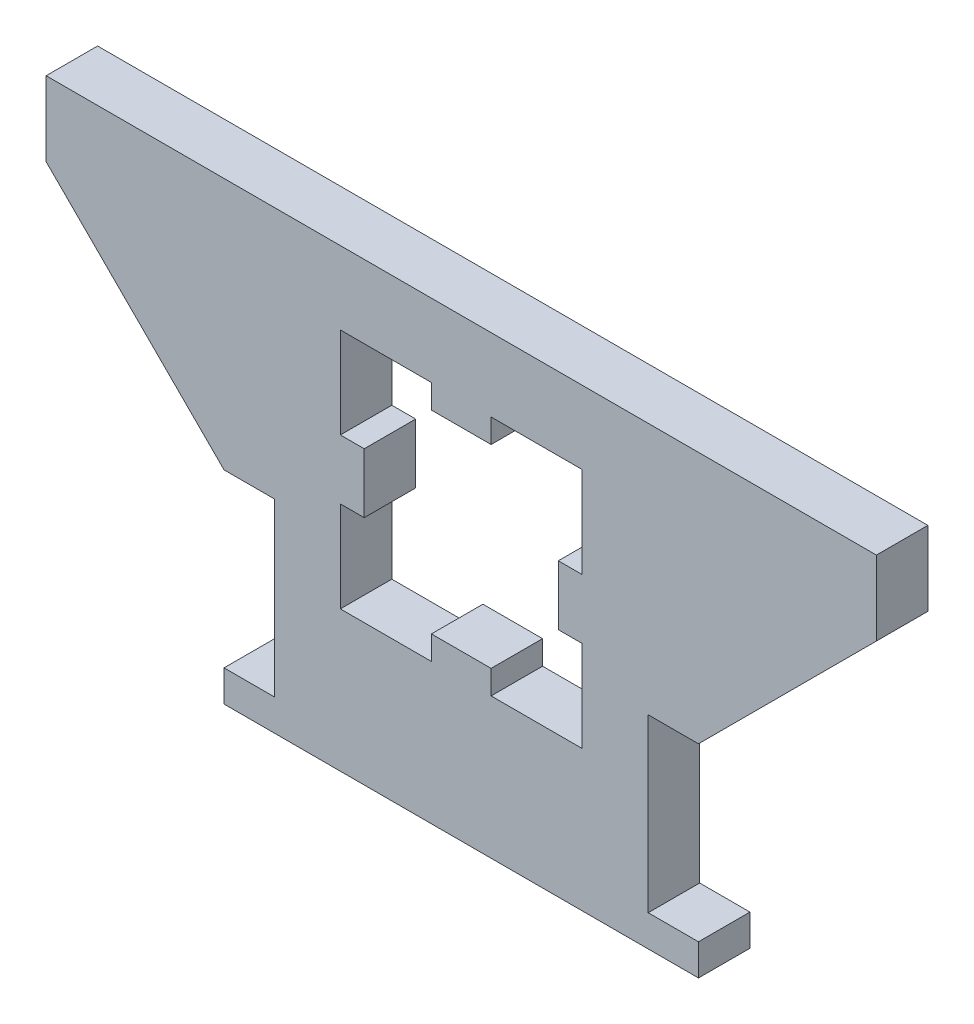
ISO-10303-21;
HEADER;
FILE_DESCRIPTION(('STEP AP214'),'2;1');
FILE_NAME('part.step','',(''),(''),'','','');
FILE_SCHEMA(('AUTOMOTIVE_DESIGN { 1 0 10303 214 1 1 1 1 }'));
ENDSEC;
DATA;
#1=APPLICATION_CONTEXT('core data for automotive mechanical design processes');
#2=APPLICATION_PROTOCOL_DEFINITION('international standard','automotive_design',2000,#1);
#3=PRODUCT_CONTEXT('',#1,'mechanical');
#4=PRODUCT('Part','Part','',(#3));
#5=PRODUCT_RELATED_PRODUCT_CATEGORY('part','',(#4));
#6=PRODUCT_DEFINITION_FORMATION('','',#4);
#7=PRODUCT_DEFINITION_CONTEXT('part definition',#1,'design');
#8=PRODUCT_DEFINITION('design','',#6,#7);
#9=PRODUCT_DEFINITION_SHAPE('','',#8);
#10=(LENGTH_UNIT() NAMED_UNIT(*) SI_UNIT(.MILLI.,.METRE.));
#11=(NAMED_UNIT(*) PLANE_ANGLE_UNIT() SI_UNIT($,.RADIAN.));
#12=(NAMED_UNIT(*) SI_UNIT($,.STERADIAN.) SOLID_ANGLE_UNIT());
#13=UNCERTAINTY_MEASURE_WITH_UNIT(LENGTH_MEASURE(1.E-05),#10,'distance_accuracy_value','');
#14=(GEOMETRIC_REPRESENTATION_CONTEXT(3) GLOBAL_UNCERTAINTY_ASSIGNED_CONTEXT((#13)) GLOBAL_UNIT_ASSIGNED_CONTEXT((#10,
#11,#12)) REPRESENTATION_CONTEXT('',''));
#15=CARTESIAN_POINT('',(0.,0.,0.));
#16=DIRECTION('',(0.,0.,1.));
#17=DIRECTION('',(1.,0.,0.));
#18=AXIS2_PLACEMENT_3D('',#15,#16,#17);
#19=CARTESIAN_POINT('',(526.117790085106,314.081108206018,5.5118));
#20=DIRECTION('',(1.,0.,0.));
#21=DIRECTION('',(0.,0.,-1.));
#22=AXIS2_PLACEMENT_3D('',#19,#20,#21);
#23=PLANE('',#22);
#24=DIRECTION('',(0.,-1.,0.));
#25=VECTOR('',#24,1.);
#26=CARTESIAN_POINT('',(526.117790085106,314.081108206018,0.));
#27=LINE('',#26,#25);
#28=CARTESIAN_POINT('',(526.117790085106,321.263362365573,0.));
#29=VERTEX_POINT('',#28);
#30=CARTESIAN_POINT('',(526.117790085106,311.525145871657,0.));
#31=VERTEX_POINT('',#30);
#32=EDGE_CURVE('E101',#29,#31,#27,.T.);
#33=ORIENTED_EDGE('',*,*,#32,.T.);
#34=DIRECTION('',(0.,0.,1.));
#35=VECTOR('',#34,1.);
#36=CARTESIAN_POINT('',(526.117790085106,311.525145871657,-10.1113248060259));
#37=LINE('',#36,#35);
#38=CARTESIAN_POINT('',(526.117790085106,311.525145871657,5.5118));
#39=VERTEX_POINT('',#38);
#40=EDGE_CURVE('E279',#31,#39,#37,.T.);
#41=ORIENTED_EDGE('',*,*,#40,.T.);
#42=DIRECTION('',(0.,-1.,0.));
#43=VECTOR('',#42,1.);
#44=CARTESIAN_POINT('',(526.117790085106,314.081108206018,5.5118));
#45=LINE('',#44,#43);
#46=CARTESIAN_POINT('',(526.117790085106,321.263362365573,5.5118));
#47=VERTEX_POINT('',#46);
#48=EDGE_CURVE('E160',#47,#39,#45,.T.);
#49=ORIENTED_EDGE('',*,*,#48,.F.);
#50=DIRECTION('',(0.,0.,-1.));
#51=VECTOR('',#50,1.);
#52=CARTESIAN_POINT('',(526.117790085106,321.263362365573,5.5118));
#53=LINE('',#52,#51);
#54=EDGE_CURVE('E165',#47,#29,#53,.T.);
#55=ORIENTED_EDGE('',*,*,#54,.T.);
#56=EDGE_LOOP('',(#33,#41,#49,#55));
#57=FACE_BOUND('',#56,.T.);
#58=ADVANCED_FACE('F34',(#57),#23,.F.);
#59=CARTESIAN_POINT('',(475.637533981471,345.212729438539,5.5118));
#60=DIRECTION('',(0.,-1.,0.));
#61=DIRECTION('',(0.,0.,-1.));
#62=AXIS2_PLACEMENT_3D('',#59,#60,#61);
#63=PLANE('',#62);
#64=DIRECTION('',(-1.,0.,0.));
#65=VECTOR('',#64,1.);
#66=CARTESIAN_POINT('',(475.637533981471,345.212729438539,0.));
#67=LINE('',#66,#65);
#68=CARTESIAN_POINT('',(557.621840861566,345.212729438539,0.));
#69=VERTEX_POINT('',#68);
#70=CARTESIAN_POINT('',(468.721840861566,345.212729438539,0.));
#71=VERTEX_POINT('',#70);
#72=EDGE_CURVE('E166',#69,#71,#67,.T.);
#73=ORIENTED_EDGE('',*,*,#72,.T.);
#74=DIRECTION('',(0.,0.,1.));
#75=VECTOR('',#74,1.);
#76=CARTESIAN_POINT('',(468.721840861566,345.212729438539,-101.385284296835));
#77=LINE('',#76,#75);
#78=CARTESIAN_POINT('',(468.721840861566,345.212729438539,5.5118));
#79=VERTEX_POINT('',#78);
#80=EDGE_CURVE('E369',#71,#79,#77,.T.);
#81=ORIENTED_EDGE('',*,*,#80,.T.);
#82=DIRECTION('',(-1.,0.,0.));
#83=VECTOR('',#82,1.);
#84=CARTESIAN_POINT('',(475.637533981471,345.212729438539,5.5118));
#85=LINE('',#84,#83);
#86=CARTESIAN_POINT('',(557.621840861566,345.212729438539,5.5118));
#87=VERTEX_POINT('',#86);
#88=EDGE_CURVE('E199',#87,#79,#85,.T.);
#89=ORIENTED_EDGE('',*,*,#88,.F.);
#90=DIRECTION('',(0.,0.,1.));
#91=VECTOR('',#90,1.);
#92=CARTESIAN_POINT('',(557.621840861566,345.212729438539,-101.385284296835));
#93=LINE('',#92,#91);
#94=EDGE_CURVE('E344',#69,#87,#93,.T.);
#95=ORIENTED_EDGE('',*,*,#94,.F.);
#96=EDGE_LOOP('',(#73,#81,#89,#95));
#97=FACE_BOUND('',#96,.T.);
#98=ADVANCED_FACE('F36',(#97),#63,.F.);
#99=CARTESIAN_POINT('',(500.225891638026,314.081108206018,5.5118));
#100=DIRECTION('',(-1.,0.,0.));
#101=DIRECTION('',(0.,0.,1.));
#102=AXIS2_PLACEMENT_3D('',#99,#100,#101);
#103=PLANE('',#102);
#104=DIRECTION('',(0.,1.,0.));
#105=VECTOR('',#104,1.);
#106=CARTESIAN_POINT('',(500.225891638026,301.381108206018,5.5118));
#107=LINE('',#106,#105);
#108=CARTESIAN_POINT('',(500.225891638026,311.525145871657,5.5118));
#109=VERTEX_POINT('',#108);
#110=CARTESIAN_POINT('',(500.225891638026,321.263362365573,5.5118));
#111=VERTEX_POINT('',#110);
#112=EDGE_CURVE('E109',#109,#111,#107,.T.);
#113=ORIENTED_EDGE('',*,*,#112,.F.);
#114=DIRECTION('',(0.,0.,1.));
#115=VECTOR('',#114,1.);
#116=CARTESIAN_POINT('',(500.225891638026,311.525145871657,-10.1113248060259));
#117=LINE('',#116,#115);
#118=CARTESIAN_POINT('',(500.225891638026,311.525145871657,0.));
#119=VERTEX_POINT('',#118);
#120=EDGE_CURVE('E284',#119,#109,#117,.T.);
#121=ORIENTED_EDGE('',*,*,#120,.F.);
#122=DIRECTION('',(0.,1.,0.));
#123=VECTOR('',#122,1.);
#124=CARTESIAN_POINT('',(500.225891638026,314.081108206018,0.));
#125=LINE('',#124,#123);
#126=CARTESIAN_POINT('',(500.225891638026,321.263362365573,0.));
#127=VERTEX_POINT('',#126);
#128=EDGE_CURVE('E169',#119,#127,#125,.T.);
#129=ORIENTED_EDGE('',*,*,#128,.T.);
#130=DIRECTION('',(0.,0.,-1.));
#131=VECTOR('',#130,1.);
#132=CARTESIAN_POINT('',(500.225891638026,321.263362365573,5.5118));
#133=LINE('',#132,#131);
#134=EDGE_CURVE('E11',#111,#127,#133,.T.);
#135=ORIENTED_EDGE('',*,*,#134,.F.);
#136=EDGE_LOOP('',(#113,#121,#129,#135));
#137=FACE_BOUND('',#136,.T.);
#138=ADVANCED_FACE('F454',(#137),#103,.F.);
#139=CARTESIAN_POINT('',(500.225891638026,321.263362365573,5.5118));
#140=DIRECTION('',(0.,1.,0.));
#141=DIRECTION('',(0.,0.,1.));
#142=AXIS2_PLACEMENT_3D('',#139,#140,#141);
#143=PLANE('',#142);
#144=DIRECTION('',(1.,0.,0.));
#145=VECTOR('',#144,1.);
#146=CARTESIAN_POINT('',(500.225891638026,321.263362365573,0.));
#147=LINE('',#146,#145);
#148=CARTESIAN_POINT('',(502.781853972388,321.263362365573,0.));
#149=VERTEX_POINT('',#148);
#150=EDGE_CURVE('E172',#127,#149,#147,.T.);
#151=ORIENTED_EDGE('',*,*,#150,.T.);
#152=DIRECTION('',(0.,0.,-1.));
#153=VECTOR('',#152,1.);
#154=CARTESIAN_POINT('',(502.781853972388,321.263362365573,5.5118));
#155=LINE('',#154,#153);
#156=CARTESIAN_POINT('',(502.781853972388,321.263362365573,5.5118));
#157=VERTEX_POINT('',#156);
#158=EDGE_CURVE('E43',#157,#149,#155,.T.);
#159=ORIENTED_EDGE('',*,*,#158,.F.);
#160=DIRECTION('',(1.,0.,0.));
#161=VECTOR('',#160,1.);
#162=CARTESIAN_POINT('',(500.225891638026,321.263362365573,5.5118));
#163=LINE('',#162,#161);
#164=EDGE_CURVE('E451',#111,#157,#163,.T.);
#165=ORIENTED_EDGE('',*,*,#164,.F.);
#166=ORIENTED_EDGE('',*,*,#134,.T.);
#167=EDGE_LOOP('',(#151,#159,#165,#166));
#168=FACE_BOUND('',#167,.T.);
#169=ADVANCED_FACE('F452',(#168),#143,.F.);
#170=CARTESIAN_POINT('',(502.781853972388,321.263362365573,5.5118));
#171=DIRECTION('',(-1.,0.,0.));
#172=DIRECTION('',(0.,0.,1.));
#173=AXIS2_PLACEMENT_3D('',#170,#171,#172);
#174=PLANE('',#173);
#175=DIRECTION('',(0.,1.,0.));
#176=VECTOR('',#175,1.);
#177=CARTESIAN_POINT('',(502.781853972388,321.263362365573,0.));
#178=LINE('',#177,#176);
#179=CARTESIAN_POINT('',(502.781853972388,327.653268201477,0.));
#180=VERTEX_POINT('',#179);
#181=EDGE_CURVE('E174',#149,#180,#178,.T.);
#182=ORIENTED_EDGE('',*,*,#181,.T.);
#183=DIRECTION('',(0.,0.,-1.));
#184=VECTOR('',#183,1.);
#185=CARTESIAN_POINT('',(502.781853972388,327.653268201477,5.5118));
#186=LINE('',#185,#184);
#187=CARTESIAN_POINT('',(502.781853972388,327.653268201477,5.5118));
#188=VERTEX_POINT('',#187);
#189=EDGE_CURVE('E219',#188,#180,#186,.T.);
#190=ORIENTED_EDGE('',*,*,#189,.F.);
#191=DIRECTION('',(0.,1.,0.));
#192=VECTOR('',#191,1.);
#193=CARTESIAN_POINT('',(502.781853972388,321.263362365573,5.5118));
#194=LINE('',#193,#192);
#195=EDGE_CURVE('E228',#157,#188,#194,.T.);
#196=ORIENTED_EDGE('',*,*,#195,.F.);
#197=ORIENTED_EDGE('',*,*,#158,.T.);
#198=EDGE_LOOP('',(#182,#190,#196,#197));
#199=FACE_BOUND('',#198,.T.);
#200=ADVANCED_FACE('F226',(#199),#174,.F.);
#201=CARTESIAN_POINT('',(502.781853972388,327.653268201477,5.5118));
#202=DIRECTION('',(0.,-1.,0.));
#203=DIRECTION('',(0.,0.,-1.));
#204=AXIS2_PLACEMENT_3D('',#201,#202,#203);
#205=PLANE('',#204);
#206=DIRECTION('',(-1.,0.,0.));
#207=VECTOR('',#206,1.);
#208=CARTESIAN_POINT('',(502.781853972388,327.653268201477,0.));
#209=LINE('',#208,#207);
#210=CARTESIAN_POINT('',(500.225891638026,327.653268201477,0.));
#211=VERTEX_POINT('',#210);
#212=EDGE_CURVE('E176',#180,#211,#209,.T.);
#213=ORIENTED_EDGE('',*,*,#212,.T.);
#214=DIRECTION('',(0.,0.,-1.));
#215=VECTOR('',#214,1.);
#216=CARTESIAN_POINT('',(500.225891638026,327.653268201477,5.5118));
#217=LINE('',#216,#215);
#218=CARTESIAN_POINT('',(500.225891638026,327.653268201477,5.5118));
#219=VERTEX_POINT('',#218);
#220=EDGE_CURVE('E216',#219,#211,#217,.T.);
#221=ORIENTED_EDGE('',*,*,#220,.F.);
#222=DIRECTION('',(-1.,0.,0.));
#223=VECTOR('',#222,1.);
#224=CARTESIAN_POINT('',(502.781853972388,327.653268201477,5.5118));
#225=LINE('',#224,#223);
#226=EDGE_CURVE('E253',#188,#219,#225,.T.);
#227=ORIENTED_EDGE('',*,*,#226,.F.);
#228=ORIENTED_EDGE('',*,*,#189,.T.);
#229=EDGE_LOOP('',(#213,#221,#227,#228));
#230=FACE_BOUND('',#229,.T.);
#231=ADVANCED_FACE('F240',(#230),#205,.F.);
#232=CARTESIAN_POINT('',(500.225891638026,327.653268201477,5.5118));
#233=DIRECTION('',(-1.,0.,0.));
#234=DIRECTION('',(0.,0.,1.));
#235=AXIS2_PLACEMENT_3D('',#232,#233,#234);
#236=PLANE('',#235);
#237=DIRECTION('',(0.,1.,0.));
#238=VECTOR('',#237,1.);
#239=CARTESIAN_POINT('',(500.225891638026,327.653268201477,0.));
#240=LINE('',#239,#238);
#241=CARTESIAN_POINT('',(500.225891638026,337.391484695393,0.));
#242=VERTEX_POINT('',#241);
#243=EDGE_CURVE('E178',#211,#242,#240,.T.);
#244=ORIENTED_EDGE('',*,*,#243,.T.);
#245=DIRECTION('',(0.,0.,1.));
#246=VECTOR('',#245,1.);
#247=CARTESIAN_POINT('',(500.225891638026,337.391484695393,-10.1113248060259));
#248=LINE('',#247,#246);
#249=CARTESIAN_POINT('',(500.225891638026,337.391484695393,5.5118));
#250=VERTEX_POINT('',#249);
#251=EDGE_CURVE('E251',#242,#250,#248,.T.);
#252=ORIENTED_EDGE('',*,*,#251,.T.);
#253=DIRECTION('',(0.,1.,0.));
#254=VECTOR('',#253,1.);
#255=CARTESIAN_POINT('',(500.225891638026,327.653268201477,5.5118));
#256=LINE('',#255,#254);
#257=EDGE_CURVE('E249',#219,#250,#256,.T.);
#258=ORIENTED_EDGE('',*,*,#257,.F.);
#259=ORIENTED_EDGE('',*,*,#220,.T.);
#260=EDGE_LOOP('',(#244,#252,#258,#259));
#261=FACE_BOUND('',#260,.T.);
#262=ADVANCED_FACE('F244',(#261),#236,.F.);
#263=CARTESIAN_POINT('',(502.781853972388,337.391484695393,5.5118));
#264=DIRECTION('',(0.,1.,0.));
#265=DIRECTION('',(0.,0.,1.));
#266=AXIS2_PLACEMENT_3D('',#263,#264,#265);
#267=PLANE('',#266);
#268=DIRECTION('',(1.,0.,0.));
#269=VECTOR('',#268,1.);
#270=CARTESIAN_POINT('',(502.781853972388,337.391484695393,0.));
#271=LINE('',#270,#269);
#272=CARTESIAN_POINT('',(509.976887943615,337.391484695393,0.));
#273=VERTEX_POINT('',#272);
#274=EDGE_CURVE('E181',#242,#273,#271,.T.);
#275=ORIENTED_EDGE('',*,*,#274,.T.);
#276=DIRECTION('',(0.,0.,-1.));
#277=VECTOR('',#276,1.);
#278=CARTESIAN_POINT('',(509.976887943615,337.391484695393,5.5118));
#279=LINE('',#278,#277);
#280=CARTESIAN_POINT('',(509.976887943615,337.391484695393,5.5118));
#281=VERTEX_POINT('',#280);
#282=EDGE_CURVE('E213',#281,#273,#279,.T.);
#283=ORIENTED_EDGE('',*,*,#282,.F.);
#284=DIRECTION('',(1.,0.,0.));
#285=VECTOR('',#284,1.);
#286=CARTESIAN_POINT('',(502.781853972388,337.391484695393,5.5118));
#287=LINE('',#286,#285);
#288=EDGE_CURVE('E252',#250,#281,#287,.T.);
#289=ORIENTED_EDGE('',*,*,#288,.F.);
#290=ORIENTED_EDGE('',*,*,#251,.F.);
#291=EDGE_LOOP('',(#275,#283,#289,#290));
#292=FACE_BOUND('',#291,.T.);
#293=ADVANCED_FACE('F775',(#292),#267,.F.);
#294=CARTESIAN_POINT('',(509.976887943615,337.391484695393,5.5118));
#295=DIRECTION('',(1.,0.,0.));
#296=DIRECTION('',(0.,0.,-1.));
#297=AXIS2_PLACEMENT_3D('',#294,#295,#296);
#298=PLANE('',#297);
#299=DIRECTION('',(0.,-1.,0.));
#300=VECTOR('',#299,1.);
#301=CARTESIAN_POINT('',(509.976887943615,337.391484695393,0.));
#302=LINE('',#301,#300);
#303=CARTESIAN_POINT('',(509.976887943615,334.835522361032,0.));
#304=VERTEX_POINT('',#303);
#305=EDGE_CURVE('E183',#273,#304,#302,.T.);
#306=ORIENTED_EDGE('',*,*,#305,.T.);
#307=DIRECTION('',(0.,0.,-1.));
#308=VECTOR('',#307,1.);
#309=CARTESIAN_POINT('',(509.976887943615,334.835522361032,5.5118));
#310=LINE('',#309,#308);
#311=CARTESIAN_POINT('',(509.976887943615,334.835522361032,5.5118));
#312=VERTEX_POINT('',#311);
#313=EDGE_CURVE('E210',#312,#304,#310,.T.);
#314=ORIENTED_EDGE('',*,*,#313,.F.);
#315=DIRECTION('',(0.,-1.,0.));
#316=VECTOR('',#315,1.);
#317=CARTESIAN_POINT('',(509.976887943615,337.391484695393,5.5118));
#318=LINE('',#317,#316);
#319=EDGE_CURVE('E255',#281,#312,#318,.T.);
#320=ORIENTED_EDGE('',*,*,#319,.F.);
#321=ORIENTED_EDGE('',*,*,#282,.T.);
#322=EDGE_LOOP('',(#306,#314,#320,#321));
#323=FACE_BOUND('',#322,.T.);
#324=ADVANCED_FACE('F786',(#323),#298,.F.);
#325=CARTESIAN_POINT('',(509.976887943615,334.835522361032,5.5118));
#326=DIRECTION('',(0.,1.,0.));
#327=DIRECTION('',(0.,0.,1.));
#328=AXIS2_PLACEMENT_3D('',#325,#326,#327);
#329=PLANE('',#328);
#330=DIRECTION('',(1.,0.,0.));
#331=VECTOR('',#330,1.);
#332=CARTESIAN_POINT('',(509.976887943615,334.835522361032,0.));
#333=LINE('',#332,#331);
#334=CARTESIAN_POINT('',(516.366793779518,334.835522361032,0.));
#335=VERTEX_POINT('',#334);
#336=EDGE_CURVE('E185',#304,#335,#333,.T.);
#337=ORIENTED_EDGE('',*,*,#336,.T.);
#338=DIRECTION('',(0.,0.,-1.));
#339=VECTOR('',#338,1.);
#340=CARTESIAN_POINT('',(516.366793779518,334.835522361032,5.5118));
#341=LINE('',#340,#339);
#342=CARTESIAN_POINT('',(516.366793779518,334.835522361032,5.5118));
#343=VERTEX_POINT('',#342);
#344=EDGE_CURVE('E207',#343,#335,#341,.T.);
#345=ORIENTED_EDGE('',*,*,#344,.F.);
#346=DIRECTION('',(1.,0.,0.));
#347=VECTOR('',#346,1.);
#348=CARTESIAN_POINT('',(509.976887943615,334.835522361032,5.5118));
#349=LINE('',#348,#347);
#350=EDGE_CURVE('E261',#312,#343,#349,.T.);
#351=ORIENTED_EDGE('',*,*,#350,.F.);
#352=ORIENTED_EDGE('',*,*,#313,.T.);
#353=EDGE_LOOP('',(#337,#345,#351,#352));
#354=FACE_BOUND('',#353,.T.);
#355=ADVANCED_FACE('F947',(#354),#329,.F.);
#356=CARTESIAN_POINT('',(516.366793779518,337.391484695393,5.5118));
#357=DIRECTION('',(-1.,0.,0.));
#358=DIRECTION('',(0.,0.,1.));
#359=AXIS2_PLACEMENT_3D('',#356,#357,#358);
#360=PLANE('',#359);
#361=DIRECTION('',(0.,1.,0.));
#362=VECTOR('',#361,1.);
#363=CARTESIAN_POINT('',(516.366793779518,337.391484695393,0.));
#364=LINE('',#363,#362);
#365=CARTESIAN_POINT('',(516.366793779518,337.391484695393,0.));
#366=VERTEX_POINT('',#365);
#367=EDGE_CURVE('E187',#335,#366,#364,.T.);
#368=ORIENTED_EDGE('',*,*,#367,.T.);
#369=DIRECTION('',(0.,0.,-1.));
#370=VECTOR('',#369,1.);
#371=CARTESIAN_POINT('',(516.366793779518,337.391484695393,5.5118));
#372=LINE('',#371,#370);
#373=CARTESIAN_POINT('',(516.366793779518,337.391484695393,5.5118));
#374=VERTEX_POINT('',#373);
#375=EDGE_CURVE('E204',#374,#366,#372,.T.);
#376=ORIENTED_EDGE('',*,*,#375,.F.);
#377=DIRECTION('',(0.,1.,0.));
#378=VECTOR('',#377,1.);
#379=CARTESIAN_POINT('',(516.366793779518,337.391484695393,5.5118));
#380=LINE('',#379,#378);
#381=EDGE_CURVE('E263',#343,#374,#380,.T.);
#382=ORIENTED_EDGE('',*,*,#381,.F.);
#383=ORIENTED_EDGE('',*,*,#344,.T.);
#384=EDGE_LOOP('',(#368,#376,#382,#383));
#385=FACE_BOUND('',#384,.T.);
#386=ADVANCED_FACE('F582',(#385),#360,.F.);
#387=CARTESIAN_POINT('',(523.561827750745,337.391484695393,5.5118));
#388=DIRECTION('',(0.,1.,0.));
#389=DIRECTION('',(0.,0.,1.));
#390=AXIS2_PLACEMENT_3D('',#387,#388,#389);
#391=PLANE('',#390);
#392=DIRECTION('',(1.,0.,0.));
#393=VECTOR('',#392,1.);
#394=CARTESIAN_POINT('',(523.561827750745,337.391484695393,0.));
#395=LINE('',#394,#393);
#396=CARTESIAN_POINT('',(526.117790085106,337.391484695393,0.));
#397=VERTEX_POINT('',#396);
#398=EDGE_CURVE('E189',#366,#397,#395,.T.);
#399=ORIENTED_EDGE('',*,*,#398,.T.);
#400=DIRECTION('',(0.,0.,1.));
#401=VECTOR('',#400,1.);
#402=CARTESIAN_POINT('',(526.117790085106,337.391484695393,-10.1113248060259));
#403=LINE('',#402,#401);
#404=CARTESIAN_POINT('',(526.117790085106,337.391484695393,5.5118));
#405=VERTEX_POINT('',#404);
#406=EDGE_CURVE('E275',#397,#405,#403,.T.);
#407=ORIENTED_EDGE('',*,*,#406,.T.);
#408=DIRECTION('',(1.,0.,0.));
#409=VECTOR('',#408,1.);
#410=CARTESIAN_POINT('',(523.561827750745,337.391484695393,5.5118));
#411=LINE('',#410,#409);
#412=EDGE_CURVE('E265',#374,#405,#411,.T.);
#413=ORIENTED_EDGE('',*,*,#412,.F.);
#414=ORIENTED_EDGE('',*,*,#375,.T.);
#415=EDGE_LOOP('',(#399,#407,#413,#414));
#416=FACE_BOUND('',#415,.T.);
#417=ADVANCED_FACE('F276',(#416),#391,.F.);
#418=CARTESIAN_POINT('',(526.117790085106,327.653268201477,5.5118));
#419=DIRECTION('',(1.,0.,0.));
#420=DIRECTION('',(0.,0.,-1.));
#421=AXIS2_PLACEMENT_3D('',#418,#419,#420);
#422=PLANE('',#421);
#423=DIRECTION('',(0.,-1.,0.));
#424=VECTOR('',#423,1.);
#425=CARTESIAN_POINT('',(526.117790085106,327.653268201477,0.));
#426=LINE('',#425,#424);
#427=CARTESIAN_POINT('',(526.117790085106,327.653268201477,0.));
#428=VERTEX_POINT('',#427);
#429=EDGE_CURVE('E192',#397,#428,#426,.T.);
#430=ORIENTED_EDGE('',*,*,#429,.T.);
#431=DIRECTION('',(0.,0.,-1.));
#432=VECTOR('',#431,1.);
#433=CARTESIAN_POINT('',(526.117790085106,327.653268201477,5.5118));
#434=LINE('',#433,#432);
#435=CARTESIAN_POINT('',(526.117790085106,327.653268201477,5.5118));
#436=VERTEX_POINT('',#435);
#437=EDGE_CURVE('E155',#436,#428,#434,.T.);
#438=ORIENTED_EDGE('',*,*,#437,.F.);
#439=DIRECTION('',(0.,-1.,0.));
#440=VECTOR('',#439,1.);
#441=CARTESIAN_POINT('',(526.117790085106,327.653268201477,5.5118));
#442=LINE('',#441,#440);
#443=EDGE_CURVE('E146',#405,#436,#442,.T.);
#444=ORIENTED_EDGE('',*,*,#443,.F.);
#445=ORIENTED_EDGE('',*,*,#406,.F.);
#446=EDGE_LOOP('',(#430,#438,#444,#445));
#447=FACE_BOUND('',#446,.T.);
#448=ADVANCED_FACE('F574',(#447),#422,.F.);
#449=CARTESIAN_POINT('',(523.561827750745,327.653268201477,5.5118));
#450=DIRECTION('',(0.,-1.,0.));
#451=DIRECTION('',(0.,0.,-1.));
#452=AXIS2_PLACEMENT_3D('',#449,#450,#451);
#453=PLANE('',#452);
#454=DIRECTION('',(-1.,0.,0.));
#455=VECTOR('',#454,1.);
#456=CARTESIAN_POINT('',(523.561827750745,327.653268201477,0.));
#457=LINE('',#456,#455);
#458=CARTESIAN_POINT('',(523.561827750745,327.653268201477,0.));
#459=VERTEX_POINT('',#458);
#460=EDGE_CURVE('E154',#428,#459,#457,.T.);
#461=ORIENTED_EDGE('',*,*,#460,.T.);
#462=DIRECTION('',(0.,0.,-1.));
#463=VECTOR('',#462,1.);
#464=CARTESIAN_POINT('',(523.561827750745,327.653268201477,5.5118));
#465=LINE('',#464,#463);
#466=CARTESIAN_POINT('',(523.561827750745,327.653268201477,5.5118));
#467=VERTEX_POINT('',#466);
#468=EDGE_CURVE('E151',#467,#459,#465,.T.);
#469=ORIENTED_EDGE('',*,*,#468,.F.);
#470=DIRECTION('',(-1.,0.,0.));
#471=VECTOR('',#470,1.);
#472=CARTESIAN_POINT('',(523.561827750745,327.653268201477,5.5118));
#473=LINE('',#472,#471);
#474=EDGE_CURVE('E138',#436,#467,#473,.T.);
#475=ORIENTED_EDGE('',*,*,#474,.F.);
#476=ORIENTED_EDGE('',*,*,#437,.T.);
#477=EDGE_LOOP('',(#461,#469,#475,#476));
#478=FACE_BOUND('',#477,.T.);
#479=ADVANCED_FACE('F152',(#478),#453,.F.);
#480=CARTESIAN_POINT('',(523.561827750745,321.263362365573,5.5118));
#481=DIRECTION('',(1.,0.,0.));
#482=DIRECTION('',(0.,0.,-1.));
#483=AXIS2_PLACEMENT_3D('',#480,#481,#482);
#484=PLANE('',#483);
#485=DIRECTION('',(0.,-1.,0.));
#486=VECTOR('',#485,1.);
#487=CARTESIAN_POINT('',(523.561827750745,321.263362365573,0.));
#488=LINE('',#487,#486);
#489=CARTESIAN_POINT('',(523.561827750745,321.263362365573,0.));
#490=VERTEX_POINT('',#489);
#491=EDGE_CURVE('E93',#459,#490,#488,.T.);
#492=ORIENTED_EDGE('',*,*,#491,.T.);
#493=DIRECTION('',(0.,0.,-1.));
#494=VECTOR('',#493,1.);
#495=CARTESIAN_POINT('',(523.561827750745,321.263362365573,5.5118));
#496=LINE('',#495,#494);
#497=CARTESIAN_POINT('',(523.561827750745,321.263362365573,5.5118));
#498=VERTEX_POINT('',#497);
#499=EDGE_CURVE('E156',#498,#490,#496,.T.);
#500=ORIENTED_EDGE('',*,*,#499,.F.);
#501=DIRECTION('',(0.,-1.,0.));
#502=VECTOR('',#501,1.);
#503=CARTESIAN_POINT('',(523.561827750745,321.263362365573,5.5118));
#504=LINE('',#503,#502);
#505=EDGE_CURVE('E143',#467,#498,#504,.T.);
#506=ORIENTED_EDGE('',*,*,#505,.F.);
#507=ORIENTED_EDGE('',*,*,#468,.T.);
#508=EDGE_LOOP('',(#492,#500,#506,#507));
#509=FACE_BOUND('',#508,.T.);
#510=ADVANCED_FACE('F158',(#509),#484,.F.);
#511=CARTESIAN_POINT('',(526.117790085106,321.263362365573,5.5118));
#512=DIRECTION('',(0.,1.,0.));
#513=DIRECTION('',(0.,0.,1.));
#514=AXIS2_PLACEMENT_3D('',#511,#512,#513);
#515=PLANE('',#514);
#516=DIRECTION('',(1.,0.,0.));
#517=VECTOR('',#516,1.);
#518=CARTESIAN_POINT('',(526.117790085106,321.263362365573,0.));
#519=LINE('',#518,#517);
#520=EDGE_CURVE('E196',#490,#29,#519,.T.);
#521=ORIENTED_EDGE('',*,*,#520,.T.);
#522=ORIENTED_EDGE('',*,*,#54,.F.);
#523=DIRECTION('',(1.,0.,0.));
#524=VECTOR('',#523,1.);
#525=CARTESIAN_POINT('',(526.117790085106,321.263362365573,5.5118));
#526=LINE('',#525,#524);
#527=EDGE_CURVE('E51',#498,#47,#526,.T.);
#528=ORIENTED_EDGE('',*,*,#527,.F.);
#529=ORIENTED_EDGE('',*,*,#499,.T.);
#530=EDGE_LOOP('',(#521,#522,#528,#529));
#531=FACE_BOUND('',#530,.T.);
#532=ADVANCED_FACE('F572',(#531),#515,.F.);
#533=CARTESIAN_POINT('',(0.,0.,5.5118));
#534=DIRECTION('',(0.,0.,-1.));
#535=DIRECTION('',(-1.,0.,0.));
#536=AXIS2_PLACEMENT_3D('',#533,#534,#535);
#537=PLANE('',#536);
#538=DIRECTION('',(1.,0.,0.));
#539=VECTOR('',#538,1.);
#540=CARTESIAN_POINT('',(0.,311.525145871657,5.5118));
#541=LINE('',#540,#539);
#542=CARTESIAN_POINT('',(509.976887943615,311.525145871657,5.5118));
#543=VERTEX_POINT('',#542);
#544=EDGE_CURVE('E366',#109,#543,#541,.T.);
#545=ORIENTED_EDGE('',*,*,#544,.F.);
#546=ORIENTED_EDGE('',*,*,#112,.T.);
#547=ORIENTED_EDGE('',*,*,#164,.T.);
#548=ORIENTED_EDGE('',*,*,#195,.T.);
#549=ORIENTED_EDGE('',*,*,#226,.T.);
#550=ORIENTED_EDGE('',*,*,#257,.T.);
#551=ORIENTED_EDGE('',*,*,#288,.T.);
#552=ORIENTED_EDGE('',*,*,#319,.T.);
#553=ORIENTED_EDGE('',*,*,#350,.T.);
#554=ORIENTED_EDGE('',*,*,#381,.T.);
#555=ORIENTED_EDGE('',*,*,#412,.T.);
#556=ORIENTED_EDGE('',*,*,#443,.T.);
#557=ORIENTED_EDGE('',*,*,#474,.T.);
#558=ORIENTED_EDGE('',*,*,#505,.T.);
#559=ORIENTED_EDGE('',*,*,#527,.T.);
#560=ORIENTED_EDGE('',*,*,#48,.T.);
#561=DIRECTION('',(-1.,0.,0.));
#562=VECTOR('',#561,1.);
#563=CARTESIAN_POINT('',(0.,311.525145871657,5.5118));
#564=LINE('',#563,#562);
#565=CARTESIAN_POINT('',(516.366793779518,311.525145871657,5.5118));
#566=VERTEX_POINT('',#565);
#567=EDGE_CURVE('E380',#39,#566,#564,.T.);
#568=ORIENTED_EDGE('',*,*,#567,.T.);
#569=DIRECTION('',(0.,1.,0.));
#570=VECTOR('',#569,1.);
#571=CARTESIAN_POINT('',(516.366793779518,0.,5.5118));
#572=LINE('',#571,#570);
#573=CARTESIAN_POINT('',(516.366793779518,314.081108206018,5.5118));
#574=VERTEX_POINT('',#573);
#575=EDGE_CURVE('E365',#566,#574,#572,.T.);
#576=ORIENTED_EDGE('',*,*,#575,.T.);
#577=DIRECTION('',(1.,0.,0.));
#578=VECTOR('',#577,1.);
#579=CARTESIAN_POINT('',(0.,314.081108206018,5.5118));
#580=LINE('',#579,#578);
#581=CARTESIAN_POINT('',(509.976887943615,314.081108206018,5.5118));
#582=VERTEX_POINT('',#581);
#583=EDGE_CURVE('E374',#582,#574,#580,.T.);
#584=ORIENTED_EDGE('',*,*,#583,.F.);
#585=DIRECTION('',(0.,1.,0.));
#586=VECTOR('',#585,1.);
#587=CARTESIAN_POINT('',(509.976887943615,0.,5.5118));
#588=LINE('',#587,#586);
#589=EDGE_CURVE('E370',#543,#582,#588,.T.);
#590=ORIENTED_EDGE('',*,*,#589,.F.);
#591=EDGE_LOOP('',(#545,#546,#547,#548,#549,#550,#551,#552,#553,#554,#555,#556,#557,#558,#559,
#560,#568,#576,#584,#590));
#592=FACE_BOUND('',#591,.T.);
#593=DIRECTION('',(0.,1.,0.));
#594=VECTOR('',#593,1.);
#595=CARTESIAN_POINT('',(493.156640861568,318.188126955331,5.5118));
#596=LINE('',#595,#594);
#597=CARTESIAN_POINT('',(493.156640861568,299.830374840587,5.5118));
#598=VERTEX_POINT('',#597);
#599=CARTESIAN_POINT('',(493.156640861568,318.188126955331,5.5118));
#600=VERTEX_POINT('',#599);
#601=EDGE_CURVE('E288',#598,#600,#596,.T.);
#602=ORIENTED_EDGE('',*,*,#601,.F.);
#603=DIRECTION('',(1.,0.,0.));
#604=VECTOR('',#603,1.);
#605=CARTESIAN_POINT('',(493.156640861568,299.830374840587,5.5118));
#606=LINE('',#605,#604);
#607=CARTESIAN_POINT('',(487.771840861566,299.830374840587,5.5118));
#608=VERTEX_POINT('',#607);
#609=EDGE_CURVE('E292',#608,#598,#606,.T.);
#610=ORIENTED_EDGE('',*,*,#609,.F.);
#611=DIRECTION('',(0.,-1.,0.));
#612=VECTOR('',#611,1.);
#613=CARTESIAN_POINT('',(487.771840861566,0.,5.5118));
#614=LINE('',#613,#612);
#615=CARTESIAN_POINT('',(487.771840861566,296.47090066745,5.5118));
#616=VERTEX_POINT('',#615);
#617=EDGE_CURVE('E356',#608,#616,#614,.T.);
#618=ORIENTED_EDGE('',*,*,#617,.T.);
#619=DIRECTION('',(1.,0.,0.));
#620=VECTOR('',#619,1.);
#621=CARTESIAN_POINT('',(0.,296.47090066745,5.5118));
#622=LINE('',#621,#620);
#623=CARTESIAN_POINT('',(538.571840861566,296.47090066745,5.5118));
#624=VERTEX_POINT('',#623);
#625=EDGE_CURVE('E353',#616,#624,#622,.T.);
#626=ORIENTED_EDGE('',*,*,#625,.T.);
#627=DIRECTION('',(0.,1.,0.));
#628=VECTOR('',#627,1.);
#629=CARTESIAN_POINT('',(538.571840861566,0.,5.5118));
#630=LINE('',#629,#628);
#631=CARTESIAN_POINT('',(538.571840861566,299.830374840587,5.5118));
#632=VERTEX_POINT('',#631);
#633=EDGE_CURVE('E349',#624,#632,#630,.T.);
#634=ORIENTED_EDGE('',*,*,#633,.T.);
#635=DIRECTION('',(1.,0.,0.));
#636=VECTOR('',#635,1.);
#637=CARTESIAN_POINT('',(533.187040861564,299.830374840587,5.5118));
#638=LINE('',#637,#636);
#639=CARTESIAN_POINT('',(533.187040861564,299.830374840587,5.5118));
#640=VERTEX_POINT('',#639);
#641=EDGE_CURVE('E319',#640,#632,#638,.T.);
#642=ORIENTED_EDGE('',*,*,#641,.F.);
#643=DIRECTION('',(0.,-1.,0.));
#644=VECTOR('',#643,1.);
#645=CARTESIAN_POINT('',(533.187040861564,318.188126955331,5.5118));
#646=LINE('',#645,#644);
#647=CARTESIAN_POINT('',(533.187040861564,318.188126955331,5.5118));
#648=VERTEX_POINT('',#647);
#649=EDGE_CURVE('E300',#648,#640,#646,.T.);
#650=ORIENTED_EDGE('',*,*,#649,.F.);
#651=DIRECTION('',(-1.,0.,0.));
#652=VECTOR('',#651,1.);
#653=CARTESIAN_POINT('',(533.187040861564,318.188126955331,5.5118));
#654=LINE('',#653,#652);
#655=CARTESIAN_POINT('',(538.571840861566,318.188126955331,5.5118));
#656=VERTEX_POINT('',#655);
#657=EDGE_CURVE('E315',#656,#648,#654,.T.);
#658=ORIENTED_EDGE('',*,*,#657,.F.);
#659=DIRECTION('',(-0.707106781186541,-0.707106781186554,0.));
#660=VECTOR('',#659,1.);
#661=CARTESIAN_POINT('',(110.191856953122,-110.19185695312,5.5118));
#662=LINE('',#661,#660);
#663=CARTESIAN_POINT('',(557.621840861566,337.238126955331,5.5118));
#664=VERTEX_POINT('',#663);
#665=EDGE_CURVE('E345',#664,#656,#662,.T.);
#666=ORIENTED_EDGE('',*,*,#665,.F.);
#667=DIRECTION('',(0.,-1.,0.));
#668=VECTOR('',#667,1.);
#669=CARTESIAN_POINT('',(557.621840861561,-7.76320334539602E-12,5.5118));
#670=LINE('',#669,#668);
#671=EDGE_CURVE('E170',#87,#664,#670,.T.);
#672=ORIENTED_EDGE('',*,*,#671,.F.);
#673=ORIENTED_EDGE('',*,*,#88,.T.);
#674=DIRECTION('',(0.,-1.,0.));
#675=VECTOR('',#674,1.);
#676=CARTESIAN_POINT('',(468.721840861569,3.26276940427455E-12,5.5118));
#677=LINE('',#676,#675);
#678=CARTESIAN_POINT('',(468.721840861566,337.238126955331,5.5118));
#679=VERTEX_POINT('',#678);
#680=EDGE_CURVE('E362',#79,#679,#677,.T.);
#681=ORIENTED_EDGE('',*,*,#680,.T.);
#682=DIRECTION('',(0.707106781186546,-0.707106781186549,0.));
#683=VECTOR('',#682,1.);
#684=CARTESIAN_POINT('',(402.97998390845,402.979983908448,5.5118));
#685=LINE('',#684,#683);
#686=CARTESIAN_POINT('',(487.771840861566,318.188126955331,5.5118));
#687=VERTEX_POINT('',#686);
#688=EDGE_CURVE('E359',#679,#687,#685,.T.);
#689=ORIENTED_EDGE('',*,*,#688,.T.);
#690=DIRECTION('',(-1.,0.,0.));
#691=VECTOR('',#690,1.);
#692=CARTESIAN_POINT('',(493.156640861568,318.188126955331,5.5118));
#693=LINE('',#692,#691);
#694=EDGE_CURVE('E281',#600,#687,#693,.T.);
#695=ORIENTED_EDGE('',*,*,#694,.F.);
#696=EDGE_LOOP('',(#602,#610,#618,#626,#634,#642,#650,#658,#666,#672,#673,#681,#689,#695));
#697=FACE_BOUND('',#696,.T.);
#698=ADVANCED_FACE('F140',(#592,#697),#537,.F.);
#699=CARTESIAN_POINT('',(0.,0.,0.));
#700=DIRECTION('',(0.,0.,-1.));
#701=DIRECTION('',(-1.,0.,0.));
#702=AXIS2_PLACEMENT_3D('',#699,#700,#701);
#703=PLANE('',#702);
#704=ORIENTED_EDGE('',*,*,#128,.F.);
#705=DIRECTION('',(1.,0.,0.));
#706=VECTOR('',#705,1.);
#707=CARTESIAN_POINT('',(0.,311.525145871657,0.));
#708=LINE('',#707,#706);
#709=CARTESIAN_POINT('',(509.976887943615,311.525145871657,0.));
#710=VERTEX_POINT('',#709);
#711=EDGE_CURVE('E392',#119,#710,#708,.T.);
#712=ORIENTED_EDGE('',*,*,#711,.T.);
#713=DIRECTION('',(0.,1.,0.));
#714=VECTOR('',#713,1.);
#715=CARTESIAN_POINT('',(509.976887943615,0.,0.));
#716=LINE('',#715,#714);
#717=CARTESIAN_POINT('',(509.976887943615,314.081108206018,0.));
#718=VERTEX_POINT('',#717);
#719=EDGE_CURVE('E415',#710,#718,#716,.T.);
#720=ORIENTED_EDGE('',*,*,#719,.T.);
#721=DIRECTION('',(1.,0.,0.));
#722=VECTOR('',#721,1.);
#723=CARTESIAN_POINT('',(0.,314.081108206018,0.));
#724=LINE('',#723,#722);
#725=CARTESIAN_POINT('',(516.366793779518,314.081108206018,0.));
#726=VERTEX_POINT('',#725);
#727=EDGE_CURVE('E383',#718,#726,#724,.T.);
#728=ORIENTED_EDGE('',*,*,#727,.T.);
#729=DIRECTION('',(0.,1.,0.));
#730=VECTOR('',#729,1.);
#731=CARTESIAN_POINT('',(516.366793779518,0.,0.));
#732=LINE('',#731,#730);
#733=CARTESIAN_POINT('',(516.366793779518,311.525145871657,0.));
#734=VERTEX_POINT('',#733);
#735=EDGE_CURVE('E420',#734,#726,#732,.T.);
#736=ORIENTED_EDGE('',*,*,#735,.F.);
#737=DIRECTION('',(-1.,0.,0.));
#738=VECTOR('',#737,1.);
#739=CARTESIAN_POINT('',(0.,311.525145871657,0.));
#740=LINE('',#739,#738);
#741=EDGE_CURVE('E352',#31,#734,#740,.T.);
#742=ORIENTED_EDGE('',*,*,#741,.F.);
#743=ORIENTED_EDGE('',*,*,#32,.F.);
#744=ORIENTED_EDGE('',*,*,#520,.F.);
#745=ORIENTED_EDGE('',*,*,#491,.F.);
#746=ORIENTED_EDGE('',*,*,#460,.F.);
#747=ORIENTED_EDGE('',*,*,#429,.F.);
#748=ORIENTED_EDGE('',*,*,#398,.F.);
#749=ORIENTED_EDGE('',*,*,#367,.F.);
#750=ORIENTED_EDGE('',*,*,#336,.F.);
#751=ORIENTED_EDGE('',*,*,#305,.F.);
#752=ORIENTED_EDGE('',*,*,#274,.F.);
#753=ORIENTED_EDGE('',*,*,#243,.F.);
#754=ORIENTED_EDGE('',*,*,#212,.F.);
#755=ORIENTED_EDGE('',*,*,#181,.F.);
#756=ORIENTED_EDGE('',*,*,#150,.F.);
#757=EDGE_LOOP('',(#704,#712,#720,#728,#736,#742,#743,#744,#745,#746,#747,#748,#749,#750,#751,
#752,#753,#754,#755,#756));
#758=FACE_BOUND('',#757,.T.);
#759=DIRECTION('',(1.,0.,0.));
#760=VECTOR('',#759,1.);
#761=CARTESIAN_POINT('',(493.156640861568,299.830374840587,0.));
#762=LINE('',#761,#760);
#763=CARTESIAN_POINT('',(487.771840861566,299.830374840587,0.));
#764=VERTEX_POINT('',#763);
#765=CARTESIAN_POINT('',(493.156640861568,299.830374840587,0.));
#766=VERTEX_POINT('',#765);
#767=EDGE_CURVE('E306',#764,#766,#762,.T.);
#768=ORIENTED_EDGE('',*,*,#767,.T.);
#769=DIRECTION('',(0.,1.,0.));
#770=VECTOR('',#769,1.);
#771=CARTESIAN_POINT('',(493.156640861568,318.188126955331,0.));
#772=LINE('',#771,#770);
#773=CARTESIAN_POINT('',(493.156640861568,318.188126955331,0.));
#774=VERTEX_POINT('',#773);
#775=EDGE_CURVE('E302',#766,#774,#772,.T.);
#776=ORIENTED_EDGE('',*,*,#775,.T.);
#777=DIRECTION('',(-1.,0.,0.));
#778=VECTOR('',#777,1.);
#779=CARTESIAN_POINT('',(493.156640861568,318.188126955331,0.));
#780=LINE('',#779,#778);
#781=CARTESIAN_POINT('',(487.771840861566,318.188126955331,0.));
#782=VERTEX_POINT('',#781);
#783=EDGE_CURVE('E297',#774,#782,#780,.T.);
#784=ORIENTED_EDGE('',*,*,#783,.T.);
#785=DIRECTION('',(0.707106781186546,-0.707106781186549,0.));
#786=VECTOR('',#785,1.);
#787=CARTESIAN_POINT('',(402.97998390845,402.979983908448,0.));
#788=LINE('',#787,#786);
#789=CARTESIAN_POINT('',(468.721840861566,337.238126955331,0.));
#790=VERTEX_POINT('',#789);
#791=EDGE_CURVE('E406',#790,#782,#788,.T.);
#792=ORIENTED_EDGE('',*,*,#791,.F.);
#793=DIRECTION('',(0.,-1.,0.));
#794=VECTOR('',#793,1.);
#795=CARTESIAN_POINT('',(468.721840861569,3.26276940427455E-12,0.));
#796=LINE('',#795,#794);
#797=EDGE_CURVE('E410',#71,#790,#796,.T.);
#798=ORIENTED_EDGE('',*,*,#797,.F.);
#799=ORIENTED_EDGE('',*,*,#72,.F.);
#800=DIRECTION('',(0.,-1.,0.));
#801=VECTOR('',#800,1.);
#802=CARTESIAN_POINT('',(557.621840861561,-7.76320334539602E-12,0.));
#803=LINE('',#802,#801);
#804=CARTESIAN_POINT('',(557.621840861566,337.238126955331,0.));
#805=VERTEX_POINT('',#804);
#806=EDGE_CURVE('E341',#69,#805,#803,.T.);
#807=ORIENTED_EDGE('',*,*,#806,.T.);
#808=DIRECTION('',(-0.707106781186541,-0.707106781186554,0.));
#809=VECTOR('',#808,1.);
#810=CARTESIAN_POINT('',(110.191856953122,-110.19185695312,0.));
#811=LINE('',#810,#809);
#812=CARTESIAN_POINT('',(538.571840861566,318.188126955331,0.));
#813=VERTEX_POINT('',#812);
#814=EDGE_CURVE('E389',#805,#813,#811,.T.);
#815=ORIENTED_EDGE('',*,*,#814,.T.);
#816=DIRECTION('',(-1.,0.,0.));
#817=VECTOR('',#816,1.);
#818=CARTESIAN_POINT('',(533.187040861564,318.188126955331,0.));
#819=LINE('',#818,#817);
#820=CARTESIAN_POINT('',(533.187040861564,318.188126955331,0.));
#821=VERTEX_POINT('',#820);
#822=EDGE_CURVE('E332',#813,#821,#819,.T.);
#823=ORIENTED_EDGE('',*,*,#822,.T.);
#824=DIRECTION('',(0.,-1.,0.));
#825=VECTOR('',#824,1.);
#826=CARTESIAN_POINT('',(533.187040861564,318.188126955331,0.));
#827=LINE('',#826,#825);
#828=CARTESIAN_POINT('',(533.187040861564,299.830374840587,0.));
#829=VERTEX_POINT('',#828);
#830=EDGE_CURVE('E327',#821,#829,#827,.T.);
#831=ORIENTED_EDGE('',*,*,#830,.T.);
#832=DIRECTION('',(1.,0.,0.));
#833=VECTOR('',#832,1.);
#834=CARTESIAN_POINT('',(533.187040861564,299.830374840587,0.));
#835=LINE('',#834,#833);
#836=CARTESIAN_POINT('',(538.571840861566,299.830374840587,0.));
#837=VERTEX_POINT('',#836);
#838=EDGE_CURVE('E318',#829,#837,#835,.T.);
#839=ORIENTED_EDGE('',*,*,#838,.T.);
#840=DIRECTION('',(0.,1.,0.));
#841=VECTOR('',#840,1.);
#842=CARTESIAN_POINT('',(538.571840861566,0.,0.));
#843=LINE('',#842,#841);
#844=CARTESIAN_POINT('',(538.571840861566,296.47090066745,0.));
#845=VERTEX_POINT('',#844);
#846=EDGE_CURVE('E393',#845,#837,#843,.T.);
#847=ORIENTED_EDGE('',*,*,#846,.F.);
#848=DIRECTION('',(1.,0.,0.));
#849=VECTOR('',#848,1.);
#850=CARTESIAN_POINT('',(0.,296.47090066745,0.));
#851=LINE('',#850,#849);
#852=CARTESIAN_POINT('',(487.771840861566,296.47090066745,0.));
#853=VERTEX_POINT('',#852);
#854=EDGE_CURVE('E398',#853,#845,#851,.T.);
#855=ORIENTED_EDGE('',*,*,#854,.F.);
#856=DIRECTION('',(0.,-1.,0.));
#857=VECTOR('',#856,1.);
#858=CARTESIAN_POINT('',(487.771840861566,0.,0.));
#859=LINE('',#858,#857);
#860=EDGE_CURVE('E402',#764,#853,#859,.T.);
#861=ORIENTED_EDGE('',*,*,#860,.F.);
#862=EDGE_LOOP('',(#768,#776,#784,#792,#798,#799,#807,#815,#823,#831,#839,#847,#855,#861));
#863=FACE_BOUND('',#862,.T.);
#864=ADVANCED_FACE('F234',(#758,#863),#703,.T.);
#865=CARTESIAN_POINT('',(0.,311.525145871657,-101.385284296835));
#866=DIRECTION('',(0.,1.,0.));
#867=DIRECTION('',(0.,0.,1.));
#868=AXIS2_PLACEMENT_3D('',#865,#866,#867);
#869=PLANE('',#868);
#870=ORIENTED_EDGE('',*,*,#567,.F.);
#871=ORIENTED_EDGE('',*,*,#40,.F.);
#872=ORIENTED_EDGE('',*,*,#741,.T.);
#873=DIRECTION('',(0.,0.,1.));
#874=VECTOR('',#873,1.);
#875=CARTESIAN_POINT('',(516.366793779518,311.525145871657,-101.385284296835));
#876=LINE('',#875,#874);
#877=EDGE_CURVE('E386',#734,#566,#876,.T.);
#878=ORIENTED_EDGE('',*,*,#877,.T.);
#879=EDGE_LOOP('',(#870,#871,#872,#878));
#880=FACE_BOUND('',#879,.T.);
#881=ADVANCED_FACE('F568',(#880),#869,.T.);
#882=CARTESIAN_POINT('',(516.366793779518,0.,-101.385284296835));
#883=DIRECTION('',(1.,0.,0.));
#884=DIRECTION('',(0.,0.,-1.));
#885=AXIS2_PLACEMENT_3D('',#882,#883,#884);
#886=PLANE('',#885);
#887=ORIENTED_EDGE('',*,*,#877,.F.);
#888=ORIENTED_EDGE('',*,*,#735,.T.);
#889=DIRECTION('',(0.,0.,1.));
#890=VECTOR('',#889,1.);
#891=CARTESIAN_POINT('',(516.366793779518,314.081108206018,-101.385284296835));
#892=LINE('',#891,#890);
#893=EDGE_CURVE('E423',#726,#574,#892,.T.);
#894=ORIENTED_EDGE('',*,*,#893,.T.);
#895=ORIENTED_EDGE('',*,*,#575,.F.);
#896=EDGE_LOOP('',(#887,#888,#894,#895));
#897=FACE_BOUND('',#896,.T.);
#898=ADVANCED_FACE('F565',(#897),#886,.T.);
#899=CARTESIAN_POINT('',(0.,314.081108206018,-101.385284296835));
#900=DIRECTION('',(0.,-1.,0.));
#901=DIRECTION('',(0.,0.,-1.));
#902=AXIS2_PLACEMENT_3D('',#899,#900,#901);
#903=PLANE('',#902);
#904=ORIENTED_EDGE('',*,*,#727,.F.);
#905=DIRECTION('',(0.,0.,1.));
#906=VECTOR('',#905,1.);
#907=CARTESIAN_POINT('',(509.976887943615,314.081108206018,-101.385284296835));
#908=LINE('',#907,#906);
#909=EDGE_CURVE('E377',#718,#582,#908,.T.);
#910=ORIENTED_EDGE('',*,*,#909,.T.);
#911=ORIENTED_EDGE('',*,*,#583,.T.);
#912=ORIENTED_EDGE('',*,*,#893,.F.);
#913=EDGE_LOOP('',(#904,#910,#911,#912));
#914=FACE_BOUND('',#913,.T.);
#915=ADVANCED_FACE('F561',(#914),#903,.F.);
#916=CARTESIAN_POINT('',(509.976887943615,0.,-101.385284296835));
#917=DIRECTION('',(1.,0.,0.));
#918=DIRECTION('',(0.,0.,-1.));
#919=AXIS2_PLACEMENT_3D('',#916,#917,#918);
#920=PLANE('',#919);
#921=ORIENTED_EDGE('',*,*,#719,.F.);
#922=DIRECTION('',(0.,0.,1.));
#923=VECTOR('',#922,1.);
#924=CARTESIAN_POINT('',(509.976887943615,311.525145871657,-101.385284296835));
#925=LINE('',#924,#923);
#926=EDGE_CURVE('E373',#710,#543,#925,.T.);
#927=ORIENTED_EDGE('',*,*,#926,.T.);
#928=ORIENTED_EDGE('',*,*,#589,.T.);
#929=ORIENTED_EDGE('',*,*,#909,.F.);
#930=EDGE_LOOP('',(#921,#927,#928,#929));
#931=FACE_BOUND('',#930,.T.);
#932=ADVANCED_FACE('F634',(#931),#920,.F.);
#933=CARTESIAN_POINT('',(0.,311.525145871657,-101.385284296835));
#934=DIRECTION('',(0.,-1.,0.));
#935=DIRECTION('',(0.,0.,-1.));
#936=AXIS2_PLACEMENT_3D('',#933,#934,#935);
#937=PLANE('',#936);
#938=ORIENTED_EDGE('',*,*,#711,.F.);
#939=ORIENTED_EDGE('',*,*,#120,.T.);
#940=ORIENTED_EDGE('',*,*,#544,.T.);
#941=ORIENTED_EDGE('',*,*,#926,.F.);
#942=EDGE_LOOP('',(#938,#939,#940,#941));
#943=FACE_BOUND('',#942,.T.);
#944=ADVANCED_FACE('F641',(#943),#937,.F.);
#945=CARTESIAN_POINT('',(468.721840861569,3.26276940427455E-12,-101.385284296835));
#946=DIRECTION('',(-1.,0.,0.));
#947=DIRECTION('',(0.,-1.,0.));
#948=AXIS2_PLACEMENT_3D('',#945,#946,#947);
#949=PLANE('',#948);
#950=ORIENTED_EDGE('',*,*,#80,.F.);
#951=ORIENTED_EDGE('',*,*,#797,.T.);
#952=DIRECTION('',(0.,0.,1.));
#953=VECTOR('',#952,1.);
#954=CARTESIAN_POINT('',(468.721840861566,337.238126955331,-101.385284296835));
#955=LINE('',#954,#953);
#956=EDGE_CURVE('E409',#790,#679,#955,.T.);
#957=ORIENTED_EDGE('',*,*,#956,.T.);
#958=ORIENTED_EDGE('',*,*,#680,.F.);
#959=EDGE_LOOP('',(#950,#951,#957,#958));
#960=FACE_BOUND('',#959,.T.);
#961=ADVANCED_FACE('F649',(#960),#949,.T.);
#962=CARTESIAN_POINT('',(402.97998390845,402.979983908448,-101.385284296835));
#963=DIRECTION('',(-0.707106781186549,-0.707106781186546,0.));
#964=DIRECTION('',(0.707106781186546,-0.707106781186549,0.));
#965=AXIS2_PLACEMENT_3D('',#962,#963,#964);
#966=PLANE('',#965);
#967=ORIENTED_EDGE('',*,*,#956,.F.);
#968=ORIENTED_EDGE('',*,*,#791,.T.);
#969=DIRECTION('',(0.,0.,1.));
#970=VECTOR('',#969,1.);
#971=CARTESIAN_POINT('',(487.771840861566,318.188126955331,-101.385284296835));
#972=LINE('',#971,#970);
#973=EDGE_CURVE('E405',#782,#687,#972,.T.);
#974=ORIENTED_EDGE('',*,*,#973,.T.);
#975=ORIENTED_EDGE('',*,*,#688,.F.);
#976=EDGE_LOOP('',(#967,#968,#974,#975));
#977=FACE_BOUND('',#976,.T.);
#978=ADVANCED_FACE('F655',(#977),#966,.T.);
#979=CARTESIAN_POINT('',(487.771840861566,0.,-101.385284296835));
#980=DIRECTION('',(-1.,0.,0.));
#981=DIRECTION('',(0.,0.,1.));
#982=AXIS2_PLACEMENT_3D('',#979,#980,#981);
#983=PLANE('',#982);
#984=DIRECTION('',(0.,0.,1.));
#985=VECTOR('',#984,1.);
#986=CARTESIAN_POINT('',(487.771840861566,299.830374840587,-19.131208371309));
#987=LINE('',#986,#985);
#988=EDGE_CURVE('E291',#764,#608,#987,.T.);
#989=ORIENTED_EDGE('',*,*,#988,.F.);
#990=ORIENTED_EDGE('',*,*,#860,.T.);
#991=DIRECTION('',(0.,0.,1.));
#992=VECTOR('',#991,1.);
#993=CARTESIAN_POINT('',(487.771840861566,296.47090066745,-101.385284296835));
#994=LINE('',#993,#992);
#995=EDGE_CURVE('E401',#853,#616,#994,.T.);
#996=ORIENTED_EDGE('',*,*,#995,.T.);
#997=ORIENTED_EDGE('',*,*,#617,.F.);
#998=EDGE_LOOP('',(#989,#990,#996,#997));
#999=FACE_BOUND('',#998,.T.);
#1000=ADVANCED_FACE('F664',(#999),#983,.T.);
#1001=CARTESIAN_POINT('',(0.,296.47090066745,-101.385284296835));
#1002=DIRECTION('',(0.,-1.,0.));
#1003=DIRECTION('',(0.,0.,-1.));
#1004=AXIS2_PLACEMENT_3D('',#1001,#1002,#1003);
#1005=PLANE('',#1004);
#1006=ORIENTED_EDGE('',*,*,#995,.F.);
#1007=ORIENTED_EDGE('',*,*,#854,.T.);
#1008=DIRECTION('',(0.,0.,1.));
#1009=VECTOR('',#1008,1.);
#1010=CARTESIAN_POINT('',(538.571840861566,296.47090066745,-101.385284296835));
#1011=LINE('',#1010,#1009);
#1012=EDGE_CURVE('E397',#845,#624,#1011,.T.);
#1013=ORIENTED_EDGE('',*,*,#1012,.T.);
#1014=ORIENTED_EDGE('',*,*,#625,.F.);
#1015=EDGE_LOOP('',(#1006,#1007,#1013,#1014));
#1016=FACE_BOUND('',#1015,.T.);
#1017=ADVANCED_FACE('F673',(#1016),#1005,.T.);
#1018=CARTESIAN_POINT('',(538.571840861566,0.,-101.385284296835));
#1019=DIRECTION('',(1.,0.,0.));
#1020=DIRECTION('',(0.,0.,-1.));
#1021=AXIS2_PLACEMENT_3D('',#1018,#1019,#1020);
#1022=PLANE('',#1021);
#1023=DIRECTION('',(0.,0.,1.));
#1024=VECTOR('',#1023,1.);
#1025=CARTESIAN_POINT('',(538.571840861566,299.830374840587,-19.131208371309));
#1026=LINE('',#1025,#1024);
#1027=EDGE_CURVE('E326',#837,#632,#1026,.T.);
#1028=ORIENTED_EDGE('',*,*,#1027,.T.);
#1029=ORIENTED_EDGE('',*,*,#633,.F.);
#1030=ORIENTED_EDGE('',*,*,#1012,.F.);
#1031=ORIENTED_EDGE('',*,*,#846,.T.);
#1032=EDGE_LOOP('',(#1028,#1029,#1030,#1031));
#1033=FACE_BOUND('',#1032,.T.);
#1034=ADVANCED_FACE('F681',(#1033),#1022,.T.);
#1035=CARTESIAN_POINT('',(110.191856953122,-110.19185695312,-101.385284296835));
#1036=DIRECTION('',(-0.707106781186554,0.707106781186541,0.));
#1037=DIRECTION('',(-0.707106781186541,-0.707106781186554,0.));
#1038=AXIS2_PLACEMENT_3D('',#1035,#1036,#1037);
#1039=PLANE('',#1038);
#1040=ORIENTED_EDGE('',*,*,#814,.F.);
#1041=DIRECTION('',(0.,0.,1.));
#1042=VECTOR('',#1041,1.);
#1043=CARTESIAN_POINT('',(557.621840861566,337.238126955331,-101.385284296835));
#1044=LINE('',#1043,#1042);
#1045=EDGE_CURVE('E348',#805,#664,#1044,.T.);
#1046=ORIENTED_EDGE('',*,*,#1045,.T.);
#1047=ORIENTED_EDGE('',*,*,#665,.T.);
#1048=DIRECTION('',(0.,0.,1.));
#1049=VECTOR('',#1048,1.);
#1050=CARTESIAN_POINT('',(538.571840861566,318.188126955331,-101.385284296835));
#1051=LINE('',#1050,#1049);
#1052=EDGE_CURVE('E396',#813,#656,#1051,.T.);
#1053=ORIENTED_EDGE('',*,*,#1052,.F.);
#1054=EDGE_LOOP('',(#1040,#1046,#1047,#1053));
#1055=FACE_BOUND('',#1054,.T.);
#1056=ADVANCED_FACE('F688',(#1055),#1039,.F.);
#1057=CARTESIAN_POINT('',(557.621840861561,-7.76320334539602E-12,-101.385284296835));
#1058=DIRECTION('',(-1.,0.,0.));
#1059=DIRECTION('',(0.,-1.,0.));
#1060=AXIS2_PLACEMENT_3D('',#1057,#1058,#1059);
#1061=PLANE('',#1060);
#1062=ORIENTED_EDGE('',*,*,#806,.F.);
#1063=ORIENTED_EDGE('',*,*,#94,.T.);
#1064=ORIENTED_EDGE('',*,*,#671,.T.);
#1065=ORIENTED_EDGE('',*,*,#1045,.F.);
#1066=EDGE_LOOP('',(#1062,#1063,#1064,#1065));
#1067=FACE_BOUND('',#1066,.T.);
#1068=ADVANCED_FACE('F696',(#1067),#1061,.F.);
#1069=CARTESIAN_POINT('',(533.187040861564,299.830374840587,-19.131208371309));
#1070=DIRECTION('',(0.,-1.,0.));
#1071=DIRECTION('',(0.,0.,-1.));
#1072=AXIS2_PLACEMENT_3D('',#1069,#1070,#1071);
#1073=PLANE('',#1072);
#1074=DIRECTION('',(0.,0.,1.));
#1075=VECTOR('',#1074,1.);
#1076=CARTESIAN_POINT('',(533.187040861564,299.830374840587,-19.131208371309));
#1077=LINE('',#1076,#1075);
#1078=EDGE_CURVE('E330',#829,#640,#1077,.T.);
#1079=ORIENTED_EDGE('',*,*,#1078,.T.);
#1080=ORIENTED_EDGE('',*,*,#641,.T.);
#1081=ORIENTED_EDGE('',*,*,#1027,.F.);
#1082=ORIENTED_EDGE('',*,*,#838,.F.);
#1083=EDGE_LOOP('',(#1079,#1080,#1081,#1082));
#1084=FACE_BOUND('',#1083,.T.);
#1085=ADVANCED_FACE('F704',(#1084),#1073,.F.);
#1086=CARTESIAN_POINT('',(533.187040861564,318.188126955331,-19.131208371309));
#1087=DIRECTION('',(0.,1.,0.));
#1088=DIRECTION('',(0.,0.,1.));
#1089=AXIS2_PLACEMENT_3D('',#1086,#1087,#1088);
#1090=PLANE('',#1089);
#1091=ORIENTED_EDGE('',*,*,#1052,.T.);
#1092=ORIENTED_EDGE('',*,*,#657,.T.);
#1093=DIRECTION('',(0.,0.,1.));
#1094=VECTOR('',#1093,1.);
#1095=CARTESIAN_POINT('',(533.187040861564,318.188126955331,-19.131208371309));
#1096=LINE('',#1095,#1094);
#1097=EDGE_CURVE('E331',#821,#648,#1096,.T.);
#1098=ORIENTED_EDGE('',*,*,#1097,.F.);
#1099=ORIENTED_EDGE('',*,*,#822,.F.);
#1100=EDGE_LOOP('',(#1091,#1092,#1098,#1099));
#1101=FACE_BOUND('',#1100,.T.);
#1102=ADVANCED_FACE('F711',(#1101),#1090,.F.);
#1103=CARTESIAN_POINT('',(533.187040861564,318.188126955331,-19.131208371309));
#1104=DIRECTION('',(-1.,0.,0.));
#1105=DIRECTION('',(0.,0.,1.));
#1106=AXIS2_PLACEMENT_3D('',#1103,#1104,#1105);
#1107=PLANE('',#1106);
#1108=ORIENTED_EDGE('',*,*,#1097,.T.);
#1109=ORIENTED_EDGE('',*,*,#649,.T.);
#1110=ORIENTED_EDGE('',*,*,#1078,.F.);
#1111=ORIENTED_EDGE('',*,*,#830,.F.);
#1112=EDGE_LOOP('',(#1108,#1109,#1110,#1111));
#1113=FACE_BOUND('',#1112,.T.);
#1114=ADVANCED_FACE('F719',(#1113),#1107,.F.);
#1115=CARTESIAN_POINT('',(493.156640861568,299.830374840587,-19.131208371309));
#1116=DIRECTION('',(0.,-1.,0.));
#1117=DIRECTION('',(0.,0.,-1.));
#1118=AXIS2_PLACEMENT_3D('',#1115,#1116,#1117);
#1119=PLANE('',#1118);
#1120=ORIENTED_EDGE('',*,*,#988,.T.);
#1121=ORIENTED_EDGE('',*,*,#609,.T.);
#1122=DIRECTION('',(0.,0.,1.));
#1123=VECTOR('',#1122,1.);
#1124=CARTESIAN_POINT('',(493.156640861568,299.830374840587,-19.131208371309));
#1125=LINE('',#1124,#1123);
#1126=EDGE_CURVE('E305',#766,#598,#1125,.T.);
#1127=ORIENTED_EDGE('',*,*,#1126,.F.);
#1128=ORIENTED_EDGE('',*,*,#767,.F.);
#1129=EDGE_LOOP('',(#1120,#1121,#1127,#1128));
#1130=FACE_BOUND('',#1129,.T.);
#1131=ADVANCED_FACE('F727',(#1130),#1119,.F.);
#1132=CARTESIAN_POINT('',(493.156640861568,318.188126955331,-19.131208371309));
#1133=DIRECTION('',(1.,0.,0.));
#1134=DIRECTION('',(0.,0.,-1.));
#1135=AXIS2_PLACEMENT_3D('',#1132,#1133,#1134);
#1136=PLANE('',#1135);
#1137=ORIENTED_EDGE('',*,*,#1126,.T.);
#1138=ORIENTED_EDGE('',*,*,#601,.T.);
#1139=DIRECTION('',(0.,0.,1.));
#1140=VECTOR('',#1139,1.);
#1141=CARTESIAN_POINT('',(493.156640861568,318.188126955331,-19.131208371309));
#1142=LINE('',#1141,#1140);
#1143=EDGE_CURVE('E301',#774,#600,#1142,.T.);
#1144=ORIENTED_EDGE('',*,*,#1143,.F.);
#1145=ORIENTED_EDGE('',*,*,#775,.F.);
#1146=EDGE_LOOP('',(#1137,#1138,#1144,#1145));
#1147=FACE_BOUND('',#1146,.T.);
#1148=ADVANCED_FACE('F735',(#1147),#1136,.F.);
#1149=CARTESIAN_POINT('',(493.156640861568,318.188126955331,-19.131208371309));
#1150=DIRECTION('',(0.,1.,0.));
#1151=DIRECTION('',(0.,0.,1.));
#1152=AXIS2_PLACEMENT_3D('',#1149,#1150,#1151);
#1153=PLANE('',#1152);
#1154=ORIENTED_EDGE('',*,*,#1143,.T.);
#1155=ORIENTED_EDGE('',*,*,#694,.T.);
#1156=ORIENTED_EDGE('',*,*,#973,.F.);
#1157=ORIENTED_EDGE('',*,*,#783,.F.);
#1158=EDGE_LOOP('',(#1154,#1155,#1156,#1157));
#1159=FACE_BOUND('',#1158,.T.);
#1160=ADVANCED_FACE('F743',(#1159),#1153,.F.);
#1161=CLOSED_SHELL('',(#58,#98,#138,#169,#200,#231,#262,#293,#324,#355,#386,#417,#448,#479,#510,
#532,#698,#864,#881,#898,#915,#932,#944,#961,#978,#1000,#1017,#1034,#1056,#1068,#1085,#1102,
#1114,#1131,#1148,#1160));
#1162=MANIFOLD_SOLID_BREP('B2',#1161);
#1163=ADVANCED_BREP_SHAPE_REPRESENTATION('',(#18,#1162),#14);
#1164=SHAPE_DEFINITION_REPRESENTATION(#9,#1163);
ENDSEC;
END-ISO-10303-21;
